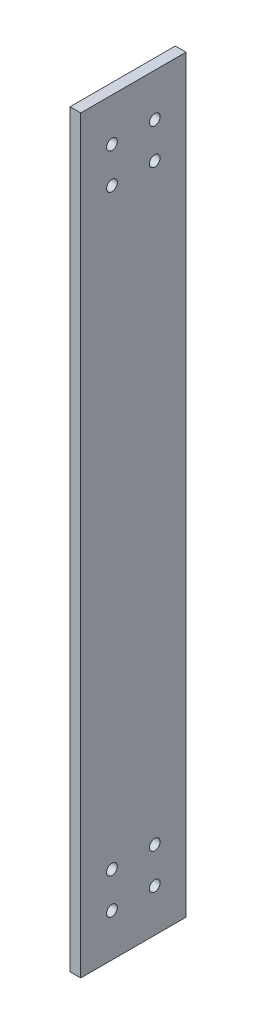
ISO-10303-21;
HEADER;
FILE_DESCRIPTION(('STEP AP214'),'2;1');
FILE_NAME('part.step','',(''),(''),'','','');
FILE_SCHEMA(('AUTOMOTIVE_DESIGN { 1 0 10303 214 1 1 1 1 }'));
ENDSEC;
DATA;
#1=APPLICATION_CONTEXT('core data for automotive mechanical design processes');
#2=APPLICATION_PROTOCOL_DEFINITION('international standard','automotive_design',2000,#1);
#3=PRODUCT_CONTEXT('',#1,'mechanical');
#4=PRODUCT('Part','Part','',(#3));
#5=PRODUCT_RELATED_PRODUCT_CATEGORY('part','',(#4));
#6=PRODUCT_DEFINITION_FORMATION('','',#4);
#7=PRODUCT_DEFINITION_CONTEXT('part definition',#1,'design');
#8=PRODUCT_DEFINITION('design','',#6,#7);
#9=PRODUCT_DEFINITION_SHAPE('','',#8);
#10=(LENGTH_UNIT() NAMED_UNIT(*) SI_UNIT(.MILLI.,.METRE.));
#11=(NAMED_UNIT(*) PLANE_ANGLE_UNIT() SI_UNIT($,.RADIAN.));
#12=(NAMED_UNIT(*) SI_UNIT($,.STERADIAN.) SOLID_ANGLE_UNIT());
#13=UNCERTAINTY_MEASURE_WITH_UNIT(LENGTH_MEASURE(1.E-05),#10,'distance_accuracy_value','');
#14=(GEOMETRIC_REPRESENTATION_CONTEXT(3) GLOBAL_UNCERTAINTY_ASSIGNED_CONTEXT((#13)) GLOBAL_UNIT_ASSIGNED_CONTEXT((#10,
#11,#12)) REPRESENTATION_CONTEXT('',''));
#15=CARTESIAN_POINT('',(0.,0.,0.));
#16=DIRECTION('',(0.,0.,1.));
#17=DIRECTION('',(1.,0.,0.));
#18=AXIS2_PLACEMENT_3D('',#15,#16,#17);
#19=CARTESIAN_POINT('',(3.,-105.,-14.75));
#20=DIRECTION('',(0.,0.,1.));
#21=DIRECTION('',(1.,0.,0.));
#22=AXIS2_PLACEMENT_3D('',#19,#20,#21);
#23=PLANE('',#22);
#24=DIRECTION('',(0.,1.,0.));
#25=VECTOR('',#24,1.);
#26=CARTESIAN_POINT('',(0.,-105.,-14.75));
#27=LINE('',#26,#25);
#28=CARTESIAN_POINT('',(0.,-105.,-14.75));
#29=VERTEX_POINT('',#28);
#30=CARTESIAN_POINT('',(0.,105.,-14.75));
#31=VERTEX_POINT('',#30);
#32=EDGE_CURVE('E113',#29,#31,#27,.T.);
#33=ORIENTED_EDGE('',*,*,#32,.T.);
#34=DIRECTION('',(-1.,0.,0.));
#35=VECTOR('',#34,1.);
#36=CARTESIAN_POINT('',(3.,105.,-14.75));
#37=LINE('',#36,#35);
#38=CARTESIAN_POINT('',(3.,105.,-14.75));
#39=VERTEX_POINT('',#38);
#40=EDGE_CURVE('E11',#39,#31,#37,.T.);
#41=ORIENTED_EDGE('',*,*,#40,.F.);
#42=DIRECTION('',(0.,1.,0.));
#43=VECTOR('',#42,1.);
#44=CARTESIAN_POINT('',(3.,-105.,-14.75));
#45=LINE('',#44,#43);
#46=CARTESIAN_POINT('',(3.,-105.,-14.75));
#47=VERTEX_POINT('',#46);
#48=EDGE_CURVE('E97',#47,#39,#45,.T.);
#49=ORIENTED_EDGE('',*,*,#48,.F.);
#50=DIRECTION('',(-1.,0.,0.));
#51=VECTOR('',#50,1.);
#52=CARTESIAN_POINT('',(3.,-105.,-14.75));
#53=LINE('',#52,#51);
#54=EDGE_CURVE('E109',#47,#29,#53,.T.);
#55=ORIENTED_EDGE('',*,*,#54,.T.);
#56=EDGE_LOOP('',(#33,#41,#49,#55));
#57=FACE_BOUND('',#56,.T.);
#58=ADVANCED_FACE('F45',(#57),#23,.F.);
#59=CARTESIAN_POINT('',(3.,105.,14.75));
#60=DIRECTION('',(0.,-1.,0.));
#61=DIRECTION('',(0.,0.,-1.));
#62=AXIS2_PLACEMENT_3D('',#59,#60,#61);
#63=PLANE('',#62);
#64=DIRECTION('',(0.,0.,1.));
#65=VECTOR('',#64,1.);
#66=CARTESIAN_POINT('',(0.,105.,14.75));
#67=LINE('',#66,#65);
#68=CARTESIAN_POINT('',(0.,105.,14.75));
#69=VERTEX_POINT('',#68);
#70=EDGE_CURVE('E102',#31,#69,#67,.T.);
#71=ORIENTED_EDGE('',*,*,#70,.T.);
#72=DIRECTION('',(-1.,0.,0.));
#73=VECTOR('',#72,1.);
#74=CARTESIAN_POINT('',(3.,105.,14.75));
#75=LINE('',#74,#73);
#76=CARTESIAN_POINT('',(3.,105.,14.75));
#77=VERTEX_POINT('',#76);
#78=EDGE_CURVE('E54',#77,#69,#75,.T.);
#79=ORIENTED_EDGE('',*,*,#78,.F.);
#80=DIRECTION('',(0.,0.,1.));
#81=VECTOR('',#80,1.);
#82=CARTESIAN_POINT('',(3.,105.,14.75));
#83=LINE('',#82,#81);
#84=EDGE_CURVE('E92',#39,#77,#83,.T.);
#85=ORIENTED_EDGE('',*,*,#84,.F.);
#86=ORIENTED_EDGE('',*,*,#40,.T.);
#87=EDGE_LOOP('',(#71,#79,#85,#86));
#88=FACE_BOUND('',#87,.T.);
#89=ADVANCED_FACE('F101',(#88),#63,.F.);
#90=CARTESIAN_POINT('',(3.,-105.,14.75));
#91=DIRECTION('',(0.,0.,-1.));
#92=DIRECTION('',(-1.,0.,0.));
#93=AXIS2_PLACEMENT_3D('',#90,#91,#92);
#94=PLANE('',#93);
#95=DIRECTION('',(0.,-1.,0.));
#96=VECTOR('',#95,1.);
#97=CARTESIAN_POINT('',(0.,-105.,14.75));
#98=LINE('',#97,#96);
#99=CARTESIAN_POINT('',(0.,-105.,14.75));
#100=VERTEX_POINT('',#99);
#101=EDGE_CURVE('E79',#69,#100,#98,.T.);
#102=ORIENTED_EDGE('',*,*,#101,.T.);
#103=DIRECTION('',(-1.,0.,0.));
#104=VECTOR('',#103,1.);
#105=CARTESIAN_POINT('',(3.,-105.,14.75));
#106=LINE('',#105,#104);
#107=CARTESIAN_POINT('',(3.,-105.,14.75));
#108=VERTEX_POINT('',#107);
#109=EDGE_CURVE('E104',#108,#100,#106,.T.);
#110=ORIENTED_EDGE('',*,*,#109,.F.);
#111=DIRECTION('',(0.,-1.,0.));
#112=VECTOR('',#111,1.);
#113=CARTESIAN_POINT('',(3.,-105.,14.75));
#114=LINE('',#113,#112);
#115=EDGE_CURVE('E95',#77,#108,#114,.T.);
#116=ORIENTED_EDGE('',*,*,#115,.F.);
#117=ORIENTED_EDGE('',*,*,#78,.T.);
#118=EDGE_LOOP('',(#102,#110,#116,#117));
#119=FACE_BOUND('',#118,.T.);
#120=ADVANCED_FACE('F105',(#119),#94,.F.);
#121=CARTESIAN_POINT('',(3.,-105.,14.75));
#122=DIRECTION('',(0.,1.,0.));
#123=DIRECTION('',(0.,0.,1.));
#124=AXIS2_PLACEMENT_3D('',#121,#122,#123);
#125=PLANE('',#124);
#126=DIRECTION('',(0.,0.,-1.));
#127=VECTOR('',#126,1.);
#128=CARTESIAN_POINT('',(0.,-105.,14.75));
#129=LINE('',#128,#127);
#130=EDGE_CURVE('E85',#100,#29,#129,.T.);
#131=ORIENTED_EDGE('',*,*,#130,.T.);
#132=ORIENTED_EDGE('',*,*,#54,.F.);
#133=DIRECTION('',(0.,0.,-1.));
#134=VECTOR('',#133,1.);
#135=CARTESIAN_POINT('',(3.,-105.,14.75));
#136=LINE('',#135,#134);
#137=EDGE_CURVE('E62',#108,#47,#136,.T.);
#138=ORIENTED_EDGE('',*,*,#137,.F.);
#139=ORIENTED_EDGE('',*,*,#109,.T.);
#140=EDGE_LOOP('',(#131,#132,#138,#139));
#141=FACE_BOUND('',#140,.T.);
#142=ADVANCED_FACE('F127',(#141),#125,.F.);
#143=CARTESIAN_POINT('',(3.,0.,0.));
#144=DIRECTION('',(-1.,0.,0.));
#145=DIRECTION('',(0.,0.,1.));
#146=AXIS2_PLACEMENT_3D('',#143,#144,#145);
#147=PLANE('',#146);
#148=CARTESIAN_POINT('',(3.,-93.,-6.));
#149=DIRECTION('',(1.,0.,0.));
#150=DIRECTION('',(0.,0.,-1.));
#151=AXIS2_PLACEMENT_3D('',#148,#149,#150);
#152=CIRCLE('',#151,1.5);
#153=CARTESIAN_POINT('',(3.,-93.,-7.5));
#154=VERTEX_POINT('',#153);
#155=EDGE_CURVE('E162',#154,#154,#152,.T.);
#156=ORIENTED_EDGE('',*,*,#155,.F.);
#157=EDGE_LOOP('',(#156));
#158=FACE_BOUND('',#157,.T.);
#159=CARTESIAN_POINT('',(3.,83.,6.));
#160=DIRECTION('',(1.,0.,0.));
#161=DIRECTION('',(0.,0.,-1.));
#162=AXIS2_PLACEMENT_3D('',#159,#160,#161);
#163=CIRCLE('',#162,1.5);
#164=CARTESIAN_POINT('',(3.,83.,4.5));
#165=VERTEX_POINT('',#164);
#166=EDGE_CURVE('E147',#165,#165,#163,.T.);
#167=ORIENTED_EDGE('',*,*,#166,.F.);
#168=EDGE_LOOP('',(#167));
#169=FACE_BOUND('',#168,.T.);
#170=CARTESIAN_POINT('',(3.,93.,6.));
#171=DIRECTION('',(1.,0.,0.));
#172=DIRECTION('',(0.,0.,-1.));
#173=AXIS2_PLACEMENT_3D('',#170,#171,#172);
#174=CIRCLE('',#173,1.5);
#175=CARTESIAN_POINT('',(3.,93.,4.5));
#176=VERTEX_POINT('',#175);
#177=EDGE_CURVE('E146',#176,#176,#174,.T.);
#178=ORIENTED_EDGE('',*,*,#177,.F.);
#179=EDGE_LOOP('',(#178));
#180=FACE_BOUND('',#179,.T.);
#181=CARTESIAN_POINT('',(3.,83.,-6.));
#182=DIRECTION('',(1.,0.,0.));
#183=DIRECTION('',(0.,0.,-1.));
#184=AXIS2_PLACEMENT_3D('',#181,#182,#183);
#185=CIRCLE('',#184,1.5);
#186=CARTESIAN_POINT('',(3.,83.,-7.5));
#187=VERTEX_POINT('',#186);
#188=EDGE_CURVE('E138',#187,#187,#185,.T.);
#189=ORIENTED_EDGE('',*,*,#188,.F.);
#190=EDGE_LOOP('',(#189));
#191=FACE_BOUND('',#190,.T.);
#192=CARTESIAN_POINT('',(3.,-83.,-6.));
#193=DIRECTION('',(1.,0.,0.));
#194=DIRECTION('',(0.,0.,-1.));
#195=AXIS2_PLACEMENT_3D('',#192,#193,#194);
#196=CIRCLE('',#195,1.5);
#197=CARTESIAN_POINT('',(3.,-83.,-7.5));
#198=VERTEX_POINT('',#197);
#199=EDGE_CURVE('E163',#198,#198,#196,.T.);
#200=ORIENTED_EDGE('',*,*,#199,.F.);
#201=EDGE_LOOP('',(#200));
#202=FACE_BOUND('',#201,.T.);
#203=CARTESIAN_POINT('',(3.,-83.,6.));
#204=DIRECTION('',(1.,0.,0.));
#205=DIRECTION('',(0.,0.,-1.));
#206=AXIS2_PLACEMENT_3D('',#203,#204,#205);
#207=CIRCLE('',#206,1.5);
#208=CARTESIAN_POINT('',(3.,-83.,4.5));
#209=VERTEX_POINT('',#208);
#210=EDGE_CURVE('E186',#209,#209,#207,.T.);
#211=ORIENTED_EDGE('',*,*,#210,.F.);
#212=EDGE_LOOP('',(#211));
#213=FACE_BOUND('',#212,.T.);
#214=CARTESIAN_POINT('',(3.,-93.,6.));
#215=DIRECTION('',(1.,0.,0.));
#216=DIRECTION('',(0.,0.,-1.));
#217=AXIS2_PLACEMENT_3D('',#214,#215,#216);
#218=CIRCLE('',#217,1.5);
#219=CARTESIAN_POINT('',(3.,-93.,4.5));
#220=VERTEX_POINT('',#219);
#221=EDGE_CURVE('E178',#220,#220,#218,.T.);
#222=ORIENTED_EDGE('',*,*,#221,.F.);
#223=EDGE_LOOP('',(#222));
#224=FACE_BOUND('',#223,.T.);
#225=CARTESIAN_POINT('',(3.,93.,-6.));
#226=DIRECTION('',(1.,0.,0.));
#227=DIRECTION('',(0.,0.,-1.));
#228=AXIS2_PLACEMENT_3D('',#225,#226,#227);
#229=CIRCLE('',#228,1.5);
#230=CARTESIAN_POINT('',(3.,93.,-7.5));
#231=VERTEX_POINT('',#230);
#232=EDGE_CURVE('E134',#231,#231,#229,.T.);
#233=ORIENTED_EDGE('',*,*,#232,.F.);
#234=EDGE_LOOP('',(#233));
#235=FACE_BOUND('',#234,.T.);
#236=ORIENTED_EDGE('',*,*,#48,.T.);
#237=ORIENTED_EDGE('',*,*,#84,.T.);
#238=ORIENTED_EDGE('',*,*,#115,.T.);
#239=ORIENTED_EDGE('',*,*,#137,.T.);
#240=EDGE_LOOP('',(#236,#237,#238,#239));
#241=FACE_BOUND('',#240,.T.);
#242=ADVANCED_FACE('F93',(#158,#169,#180,#191,#202,#213,#224,#235,#241),#147,.F.);
#243=CARTESIAN_POINT('',(0.,0.,0.));
#244=DIRECTION('',(-1.,0.,0.));
#245=DIRECTION('',(0.,0.,1.));
#246=AXIS2_PLACEMENT_3D('',#243,#244,#245);
#247=PLANE('',#246);
#248=CARTESIAN_POINT('',(0.,-93.,-6.));
#249=DIRECTION('',(1.,0.,0.));
#250=DIRECTION('',(0.,0.,-1.));
#251=AXIS2_PLACEMENT_3D('',#248,#249,#250);
#252=CIRCLE('',#251,1.5);
#253=CARTESIAN_POINT('',(0.,-93.,-7.5));
#254=VERTEX_POINT('',#253);
#255=EDGE_CURVE('E158',#254,#254,#252,.T.);
#256=ORIENTED_EDGE('',*,*,#255,.T.);
#257=EDGE_LOOP('',(#256));
#258=FACE_BOUND('',#257,.T.);
#259=CARTESIAN_POINT('',(0.,83.,6.));
#260=DIRECTION('',(1.,0.,0.));
#261=DIRECTION('',(0.,0.,-1.));
#262=AXIS2_PLACEMENT_3D('',#259,#260,#261);
#263=CIRCLE('',#262,1.5);
#264=CARTESIAN_POINT('',(0.,83.,4.5));
#265=VERTEX_POINT('',#264);
#266=EDGE_CURVE('E167',#265,#265,#263,.T.);
#267=ORIENTED_EDGE('',*,*,#266,.T.);
#268=EDGE_LOOP('',(#267));
#269=FACE_BOUND('',#268,.T.);
#270=CARTESIAN_POINT('',(0.,93.,6.));
#271=DIRECTION('',(1.,0.,0.));
#272=DIRECTION('',(0.,0.,-1.));
#273=AXIS2_PLACEMENT_3D('',#270,#271,#272);
#274=CIRCLE('',#273,1.5);
#275=CARTESIAN_POINT('',(0.,93.,4.5));
#276=VERTEX_POINT('',#275);
#277=EDGE_CURVE('E142',#276,#276,#274,.T.);
#278=ORIENTED_EDGE('',*,*,#277,.T.);
#279=EDGE_LOOP('',(#278));
#280=FACE_BOUND('',#279,.T.);
#281=CARTESIAN_POINT('',(0.,83.,-6.));
#282=DIRECTION('',(1.,0.,0.));
#283=DIRECTION('',(0.,0.,-1.));
#284=AXIS2_PLACEMENT_3D('',#281,#282,#283);
#285=CIRCLE('',#284,1.5);
#286=CARTESIAN_POINT('',(0.,83.,-7.5));
#287=VERTEX_POINT('',#286);
#288=EDGE_CURVE('E151',#287,#287,#285,.T.);
#289=ORIENTED_EDGE('',*,*,#288,.T.);
#290=EDGE_LOOP('',(#289));
#291=FACE_BOUND('',#290,.T.);
#292=CARTESIAN_POINT('',(0.,-83.,-6.));
#293=DIRECTION('',(1.,0.,0.));
#294=DIRECTION('',(0.,0.,-1.));
#295=AXIS2_PLACEMENT_3D('',#292,#293,#294);
#296=CIRCLE('',#295,1.5);
#297=CARTESIAN_POINT('',(0.,-83.,-7.5));
#298=VERTEX_POINT('',#297);
#299=EDGE_CURVE('E190',#298,#298,#296,.T.);
#300=ORIENTED_EDGE('',*,*,#299,.T.);
#301=EDGE_LOOP('',(#300));
#302=FACE_BOUND('',#301,.T.);
#303=CARTESIAN_POINT('',(0.,-83.,6.));
#304=DIRECTION('',(1.,0.,0.));
#305=DIRECTION('',(0.,0.,-1.));
#306=AXIS2_PLACEMENT_3D('',#303,#304,#305);
#307=CIRCLE('',#306,1.5);
#308=CARTESIAN_POINT('',(0.,-83.,4.5));
#309=VERTEX_POINT('',#308);
#310=EDGE_CURVE('E182',#309,#309,#307,.T.);
#311=ORIENTED_EDGE('',*,*,#310,.T.);
#312=EDGE_LOOP('',(#311));
#313=FACE_BOUND('',#312,.T.);
#314=CARTESIAN_POINT('',(0.,-93.,6.));
#315=DIRECTION('',(1.,0.,0.));
#316=DIRECTION('',(0.,0.,-1.));
#317=AXIS2_PLACEMENT_3D('',#314,#315,#316);
#318=CIRCLE('',#317,1.5);
#319=CARTESIAN_POINT('',(0.,-93.,4.5));
#320=VERTEX_POINT('',#319);
#321=EDGE_CURVE('E174',#320,#320,#318,.T.);
#322=ORIENTED_EDGE('',*,*,#321,.T.);
#323=EDGE_LOOP('',(#322));
#324=FACE_BOUND('',#323,.T.);
#325=CARTESIAN_POINT('',(0.,93.,-6.));
#326=DIRECTION('',(1.,0.,0.));
#327=DIRECTION('',(0.,0.,-1.));
#328=AXIS2_PLACEMENT_3D('',#325,#326,#327);
#329=CIRCLE('',#328,1.5);
#330=CARTESIAN_POINT('',(0.,93.,-7.5));
#331=VERTEX_POINT('',#330);
#332=EDGE_CURVE('E117',#331,#331,#329,.T.);
#333=ORIENTED_EDGE('',*,*,#332,.T.);
#334=EDGE_LOOP('',(#333));
#335=FACE_BOUND('',#334,.T.);
#336=ORIENTED_EDGE('',*,*,#32,.F.);
#337=ORIENTED_EDGE('',*,*,#130,.F.);
#338=ORIENTED_EDGE('',*,*,#101,.F.);
#339=ORIENTED_EDGE('',*,*,#70,.F.);
#340=EDGE_LOOP('',(#336,#337,#338,#339));
#341=FACE_BOUND('',#340,.T.);
#342=ADVANCED_FACE('F130',(#258,#269,#280,#291,#302,#313,#324,#335,#341),#247,.T.);
#343=CARTESIAN_POINT('',(0.,93.,-6.));
#344=DIRECTION('',(1.,0.,0.));
#345=DIRECTION('',(0.,0.,-1.));
#346=AXIS2_PLACEMENT_3D('',#343,#344,#345);
#347=CYLINDRICAL_SURFACE('',#346,1.5);
#348=ORIENTED_EDGE('',*,*,#332,.F.);
#349=EDGE_LOOP('',(#348));
#350=FACE_BOUND('',#349,.T.);
#351=ORIENTED_EDGE('',*,*,#232,.T.);
#352=EDGE_LOOP('',(#351));
#353=FACE_BOUND('',#352,.T.);
#354=ADVANCED_FACE('F210',(#350,#353),#347,.F.);
#355=CARTESIAN_POINT('',(0.,-93.,6.));
#356=DIRECTION('',(1.,0.,0.));
#357=DIRECTION('',(0.,0.,-1.));
#358=AXIS2_PLACEMENT_3D('',#355,#356,#357);
#359=CYLINDRICAL_SURFACE('',#358,1.5);
#360=ORIENTED_EDGE('',*,*,#321,.F.);
#361=EDGE_LOOP('',(#360));
#362=FACE_BOUND('',#361,.T.);
#363=ORIENTED_EDGE('',*,*,#221,.T.);
#364=EDGE_LOOP('',(#363));
#365=FACE_BOUND('',#364,.T.);
#366=ADVANCED_FACE('F212',(#362,#365),#359,.F.);
#367=CARTESIAN_POINT('',(0.,-83.,6.));
#368=DIRECTION('',(1.,0.,0.));
#369=DIRECTION('',(0.,0.,-1.));
#370=AXIS2_PLACEMENT_3D('',#367,#368,#369);
#371=CYLINDRICAL_SURFACE('',#370,1.5);
#372=ORIENTED_EDGE('',*,*,#310,.F.);
#373=EDGE_LOOP('',(#372));
#374=FACE_BOUND('',#373,.T.);
#375=ORIENTED_EDGE('',*,*,#210,.T.);
#376=EDGE_LOOP('',(#375));
#377=FACE_BOUND('',#376,.T.);
#378=ADVANCED_FACE('F219',(#374,#377),#371,.F.);
#379=CARTESIAN_POINT('',(0.,-83.,-6.));
#380=DIRECTION('',(1.,0.,0.));
#381=DIRECTION('',(0.,0.,-1.));
#382=AXIS2_PLACEMENT_3D('',#379,#380,#381);
#383=CYLINDRICAL_SURFACE('',#382,1.5);
#384=ORIENTED_EDGE('',*,*,#299,.F.);
#385=EDGE_LOOP('',(#384));
#386=FACE_BOUND('',#385,.T.);
#387=ORIENTED_EDGE('',*,*,#199,.T.);
#388=EDGE_LOOP('',(#387));
#389=FACE_BOUND('',#388,.T.);
#390=ADVANCED_FACE('F198',(#386,#389),#383,.F.);
#391=CARTESIAN_POINT('',(0.,83.,-6.));
#392=DIRECTION('',(1.,0.,0.));
#393=DIRECTION('',(0.,0.,-1.));
#394=AXIS2_PLACEMENT_3D('',#391,#392,#393);
#395=CYLINDRICAL_SURFACE('',#394,1.5);
#396=ORIENTED_EDGE('',*,*,#288,.F.);
#397=EDGE_LOOP('',(#396));
#398=FACE_BOUND('',#397,.T.);
#399=ORIENTED_EDGE('',*,*,#188,.T.);
#400=EDGE_LOOP('',(#399));
#401=FACE_BOUND('',#400,.T.);
#402=ADVANCED_FACE('F276',(#398,#401),#395,.F.);
#403=CARTESIAN_POINT('',(0.,93.,6.));
#404=DIRECTION('',(1.,0.,0.));
#405=DIRECTION('',(0.,0.,-1.));
#406=AXIS2_PLACEMENT_3D('',#403,#404,#405);
#407=CYLINDRICAL_SURFACE('',#406,1.5);
#408=ORIENTED_EDGE('',*,*,#277,.F.);
#409=EDGE_LOOP('',(#408));
#410=FACE_BOUND('',#409,.T.);
#411=ORIENTED_EDGE('',*,*,#177,.T.);
#412=EDGE_LOOP('',(#411));
#413=FACE_BOUND('',#412,.T.);
#414=ADVANCED_FACE('F286',(#410,#413),#407,.F.);
#415=CARTESIAN_POINT('',(0.,83.,6.));
#416=DIRECTION('',(1.,0.,0.));
#417=DIRECTION('',(0.,0.,-1.));
#418=AXIS2_PLACEMENT_3D('',#415,#416,#417);
#419=CYLINDRICAL_SURFACE('',#418,1.5);
#420=ORIENTED_EDGE('',*,*,#266,.F.);
#421=EDGE_LOOP('',(#420));
#422=FACE_BOUND('',#421,.T.);
#423=ORIENTED_EDGE('',*,*,#166,.T.);
#424=EDGE_LOOP('',(#423));
#425=FACE_BOUND('',#424,.T.);
#426=ADVANCED_FACE('F296',(#422,#425),#419,.F.);
#427=CARTESIAN_POINT('',(0.,-93.,-6.));
#428=DIRECTION('',(1.,0.,0.));
#429=DIRECTION('',(0.,0.,-1.));
#430=AXIS2_PLACEMENT_3D('',#427,#428,#429);
#431=CYLINDRICAL_SURFACE('',#430,1.5);
#432=ORIENTED_EDGE('',*,*,#255,.F.);
#433=EDGE_LOOP('',(#432));
#434=FACE_BOUND('',#433,.T.);
#435=ORIENTED_EDGE('',*,*,#155,.T.);
#436=EDGE_LOOP('',(#435));
#437=FACE_BOUND('',#436,.T.);
#438=ADVANCED_FACE('F305',(#434,#437),#431,.F.);
#439=CLOSED_SHELL('',(#58,#89,#120,#142,#242,#342,#354,#366,#378,#390,#402,#414,#426,#438));
#440=MANIFOLD_SOLID_BREP('B2',#439);
#441=ADVANCED_BREP_SHAPE_REPRESENTATION('',(#18,#440),#14);
#442=SHAPE_DEFINITION_REPRESENTATION(#9,#441);
ENDSEC;
END-ISO-10303-21;
